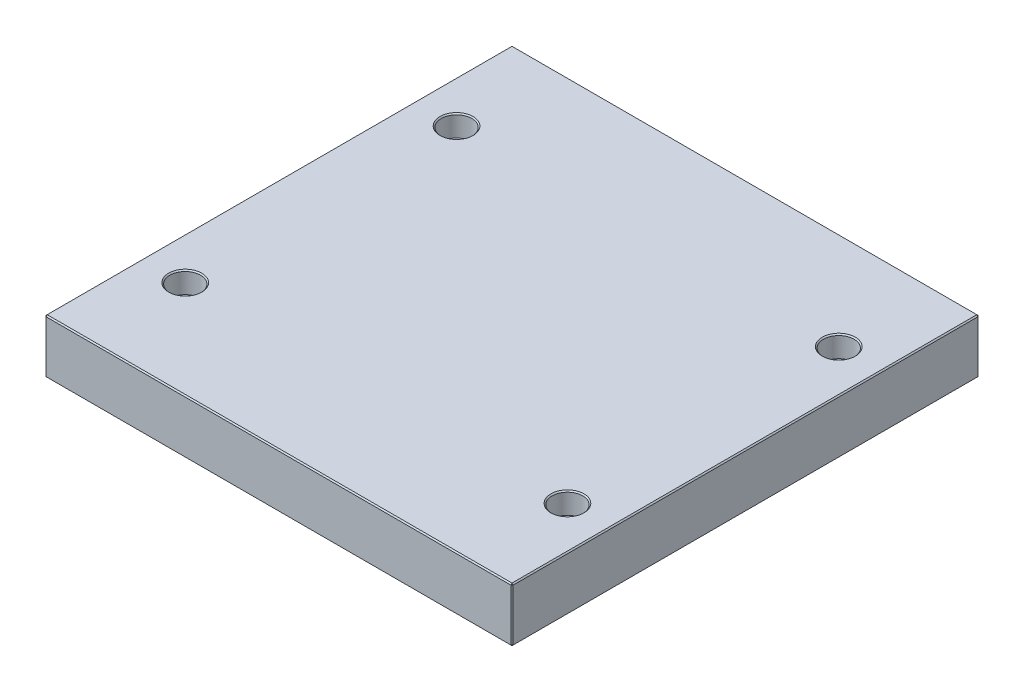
ISO-10303-21;
HEADER;
FILE_DESCRIPTION(('STEP AP214'),'2;1');
FILE_NAME('part.step','',(''),(''),'','','');
FILE_SCHEMA(('AUTOMOTIVE_DESIGN { 1 0 10303 214 1 1 1 1 }'));
ENDSEC;
DATA;
#1=APPLICATION_CONTEXT('core data for automotive mechanical design processes');
#2=APPLICATION_PROTOCOL_DEFINITION('international standard','automotive_design',2000,#1);
#3=PRODUCT_CONTEXT('',#1,'mechanical');
#4=PRODUCT('Part','Part','',(#3));
#5=PRODUCT_RELATED_PRODUCT_CATEGORY('part','',(#4));
#6=PRODUCT_DEFINITION_FORMATION('','',#4);
#7=PRODUCT_DEFINITION_CONTEXT('part definition',#1,'design');
#8=PRODUCT_DEFINITION('design','',#6,#7);
#9=PRODUCT_DEFINITION_SHAPE('','',#8);
#10=(LENGTH_UNIT() NAMED_UNIT(*) SI_UNIT(.MILLI.,.METRE.));
#11=(NAMED_UNIT(*) PLANE_ANGLE_UNIT() SI_UNIT($,.RADIAN.));
#12=(NAMED_UNIT(*) SI_UNIT($,.STERADIAN.) SOLID_ANGLE_UNIT());
#13=UNCERTAINTY_MEASURE_WITH_UNIT(LENGTH_MEASURE(1.E-05),#10,'distance_accuracy_value','');
#14=(GEOMETRIC_REPRESENTATION_CONTEXT(3) GLOBAL_UNCERTAINTY_ASSIGNED_CONTEXT((#13)) GLOBAL_UNIT_ASSIGNED_CONTEXT((#10,
#11,#12)) REPRESENTATION_CONTEXT('',''));
#15=CARTESIAN_POINT('',(0.,0.,0.));
#16=DIRECTION('',(0.,0.,1.));
#17=DIRECTION('',(1.,0.,0.));
#18=AXIS2_PLACEMENT_3D('',#15,#16,#17);
#19=CARTESIAN_POINT('',(-198.,46.,198.));
#20=DIRECTION('',(1.,0.,0.));
#21=DIRECTION('',(0.,0.,-1.));
#22=AXIS2_PLACEMENT_3D('',#19,#20,#21);
#23=PLANE('',#22);
#24=DIRECTION('',(0.,-1.,0.));
#25=VECTOR('',#24,1.);
#26=CARTESIAN_POINT('',(-198.,46.,-197.));
#27=LINE('',#26,#25);
#28=CARTESIAN_POINT('',(-198.,45.,-197.));
#29=VERTEX_POINT('',#28);
#30=CARTESIAN_POINT('',(-198.,1.,-197.));
#31=VERTEX_POINT('',#30);
#32=EDGE_CURVE('E115',#29,#31,#27,.T.);
#33=ORIENTED_EDGE('',*,*,#32,.T.);
#34=DIRECTION('',(0.,0.,1.));
#35=VECTOR('',#34,1.);
#36=CARTESIAN_POINT('',(-198.,1.,198.));
#37=LINE('',#36,#35);
#38=CARTESIAN_POINT('',(-198.,1.,197.));
#39=VERTEX_POINT('',#38);
#40=EDGE_CURVE('E111',#31,#39,#37,.T.);
#41=ORIENTED_EDGE('',*,*,#40,.T.);
#42=DIRECTION('',(0.,1.,0.));
#43=VECTOR('',#42,1.);
#44=CARTESIAN_POINT('',(-198.,46.,197.));
#45=LINE('',#44,#43);
#46=CARTESIAN_POINT('',(-198.,45.,197.));
#47=VERTEX_POINT('',#46);
#48=EDGE_CURVE('E104',#39,#47,#45,.T.);
#49=ORIENTED_EDGE('',*,*,#48,.T.);
#50=DIRECTION('',(0.,0.,-1.));
#51=VECTOR('',#50,1.);
#52=CARTESIAN_POINT('',(-198.,45.,-198.));
#53=LINE('',#52,#51);
#54=EDGE_CURVE('E108',#47,#29,#53,.T.);
#55=ORIENTED_EDGE('',*,*,#54,.T.);
#56=EDGE_LOOP('',(#33,#41,#49,#55));
#57=FACE_BOUND('',#56,.T.);
#58=ADVANCED_FACE('F16',(#57),#23,.F.);
#59=CARTESIAN_POINT('',(198.,46.,198.));
#60=DIRECTION('',(0.,0.,-1.));
#61=DIRECTION('',(-1.,0.,0.));
#62=AXIS2_PLACEMENT_3D('',#59,#60,#61);
#63=PLANE('',#62);
#64=DIRECTION('',(-1.,0.,0.));
#65=VECTOR('',#64,1.);
#66=CARTESIAN_POINT('',(-198.,45.,198.));
#67=LINE('',#66,#65);
#68=CARTESIAN_POINT('',(197.,45.,198.));
#69=VERTEX_POINT('',#68);
#70=CARTESIAN_POINT('',(-197.,45.,198.));
#71=VERTEX_POINT('',#70);
#72=EDGE_CURVE('E170',#69,#71,#67,.T.);
#73=ORIENTED_EDGE('',*,*,#72,.T.);
#74=DIRECTION('',(0.,-1.,0.));
#75=VECTOR('',#74,1.);
#76=CARTESIAN_POINT('',(-197.,46.,198.));
#77=LINE('',#76,#75);
#78=CARTESIAN_POINT('',(-197.,1.00000000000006,198.));
#79=VERTEX_POINT('',#78);
#80=EDGE_CURVE('E123',#71,#79,#77,.T.);
#81=ORIENTED_EDGE('',*,*,#80,.T.);
#82=DIRECTION('',(1.,0.,0.));
#83=VECTOR('',#82,1.);
#84=CARTESIAN_POINT('',(198.,1.00000000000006,198.));
#85=LINE('',#84,#83);
#86=CARTESIAN_POINT('',(197.,1.00000000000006,198.));
#87=VERTEX_POINT('',#86);
#88=EDGE_CURVE('E174',#79,#87,#85,.T.);
#89=ORIENTED_EDGE('',*,*,#88,.T.);
#90=DIRECTION('',(0.,1.,0.));
#91=VECTOR('',#90,1.);
#92=CARTESIAN_POINT('',(197.,46.,198.));
#93=LINE('',#92,#91);
#94=EDGE_CURVE('E172',#87,#69,#93,.T.);
#95=ORIENTED_EDGE('',*,*,#94,.T.);
#96=EDGE_LOOP('',(#73,#81,#89,#95));
#97=FACE_BOUND('',#96,.T.);
#98=ADVANCED_FACE('F317',(#97),#63,.F.);
#99=CARTESIAN_POINT('',(198.,46.,198.));
#100=DIRECTION('',(-1.,0.,0.));
#101=DIRECTION('',(0.,0.,1.));
#102=AXIS2_PLACEMENT_3D('',#99,#100,#101);
#103=PLANE('',#102);
#104=DIRECTION('',(0.,0.,-1.));
#105=VECTOR('',#104,1.);
#106=CARTESIAN_POINT('',(198.,1.00000000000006,198.));
#107=LINE('',#106,#105);
#108=CARTESIAN_POINT('',(198.,1.00000000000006,197.));
#109=VERTEX_POINT('',#108);
#110=CARTESIAN_POINT('',(198.,1.00000000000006,-197.));
#111=VERTEX_POINT('',#110);
#112=EDGE_CURVE('E165',#109,#111,#107,.T.);
#113=ORIENTED_EDGE('',*,*,#112,.T.);
#114=DIRECTION('',(0.,1.,0.));
#115=VECTOR('',#114,1.);
#116=CARTESIAN_POINT('',(198.,46.,-197.));
#117=LINE('',#116,#115);
#118=CARTESIAN_POINT('',(198.,45.,-197.));
#119=VERTEX_POINT('',#118);
#120=EDGE_CURVE('E167',#111,#119,#117,.T.);
#121=ORIENTED_EDGE('',*,*,#120,.T.);
#122=DIRECTION('',(0.,0.,1.));
#123=VECTOR('',#122,1.);
#124=CARTESIAN_POINT('',(198.,45.,198.));
#125=LINE('',#124,#123);
#126=CARTESIAN_POINT('',(198.,45.,197.));
#127=VERTEX_POINT('',#126);
#128=EDGE_CURVE('E161',#119,#127,#125,.T.);
#129=ORIENTED_EDGE('',*,*,#128,.T.);
#130=DIRECTION('',(0.,-1.,0.));
#131=VECTOR('',#130,1.);
#132=CARTESIAN_POINT('',(198.,46.,197.));
#133=LINE('',#132,#131);
#134=EDGE_CURVE('E163',#127,#109,#133,.T.);
#135=ORIENTED_EDGE('',*,*,#134,.T.);
#136=EDGE_LOOP('',(#113,#121,#129,#135));
#137=FACE_BOUND('',#136,.T.);
#138=ADVANCED_FACE('F323',(#137),#103,.F.);
#139=CARTESIAN_POINT('',(198.,46.,-198.));
#140=DIRECTION('',(0.,0.,1.));
#141=DIRECTION('',(1.,0.,0.));
#142=AXIS2_PLACEMENT_3D('',#139,#140,#141);
#143=PLANE('',#142);
#144=DIRECTION('',(0.,-1.,0.));
#145=VECTOR('',#144,1.);
#146=CARTESIAN_POINT('',(197.,46.,-198.));
#147=LINE('',#146,#145);
#148=CARTESIAN_POINT('',(197.,45.,-198.));
#149=VERTEX_POINT('',#148);
#150=CARTESIAN_POINT('',(197.,1.00000000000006,-198.));
#151=VERTEX_POINT('',#150);
#152=EDGE_CURVE('E154',#149,#151,#147,.T.);
#153=ORIENTED_EDGE('',*,*,#152,.T.);
#154=DIRECTION('',(-1.,0.,0.));
#155=VECTOR('',#154,1.);
#156=CARTESIAN_POINT('',(198.,1.00000000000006,-198.));
#157=LINE('',#156,#155);
#158=CARTESIAN_POINT('',(-197.,1.00000000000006,-198.));
#159=VERTEX_POINT('',#158);
#160=EDGE_CURVE('E159',#151,#159,#157,.T.);
#161=ORIENTED_EDGE('',*,*,#160,.T.);
#162=DIRECTION('',(0.,1.,0.));
#163=VECTOR('',#162,1.);
#164=CARTESIAN_POINT('',(-197.,46.,-198.));
#165=LINE('',#164,#163);
#166=CARTESIAN_POINT('',(-197.,45.,-198.));
#167=VERTEX_POINT('',#166);
#168=EDGE_CURVE('E156',#159,#167,#165,.T.);
#169=ORIENTED_EDGE('',*,*,#168,.T.);
#170=DIRECTION('',(1.,0.,0.));
#171=VECTOR('',#170,1.);
#172=CARTESIAN_POINT('',(198.,45.,-198.));
#173=LINE('',#172,#171);
#174=EDGE_CURVE('E152',#167,#149,#173,.T.);
#175=ORIENTED_EDGE('',*,*,#174,.T.);
#176=EDGE_LOOP('',(#153,#161,#169,#175));
#177=FACE_BOUND('',#176,.T.);
#178=ADVANCED_FACE('F465',(#177),#143,.F.);
#179=CARTESIAN_POINT('',(0.,46.,0.));
#180=DIRECTION('',(0.,1.,0.));
#181=DIRECTION('',(0.,0.,1.));
#182=AXIS2_PLACEMENT_3D('',#179,#180,#181);
#183=PLANE('',#182);
#184=CARTESIAN_POINT('',(-162.,46.,115.));
#185=DIRECTION('',(0.,1.,0.));
#186=DIRECTION('',(0.,0.,1.));
#187=AXIS2_PLACEMENT_3D('',#184,#185,#186);
#188=CIRCLE('',#187,14.);
#189=CARTESIAN_POINT('',(-162.,46.,129.));
#190=VERTEX_POINT('',#189);
#191=EDGE_CURVE('E290',#190,#190,#188,.F.);
#192=ORIENTED_EDGE('',*,*,#191,.T.);
#193=EDGE_LOOP('',(#192));
#194=FACE_BOUND('',#193,.T.);
#195=CARTESIAN_POINT('',(162.,46.,115.));
#196=DIRECTION('',(0.,1.,0.));
#197=DIRECTION('',(0.,0.,1.));
#198=AXIS2_PLACEMENT_3D('',#195,#196,#197);
#199=CIRCLE('',#198,14.);
#200=CARTESIAN_POINT('',(162.,46.,129.));
#201=VERTEX_POINT('',#200);
#202=EDGE_CURVE('E287',#201,#201,#199,.F.);
#203=ORIENTED_EDGE('',*,*,#202,.T.);
#204=EDGE_LOOP('',(#203));
#205=FACE_BOUND('',#204,.T.);
#206=CARTESIAN_POINT('',(162.,46.,-115.));
#207=DIRECTION('',(0.,1.,0.));
#208=DIRECTION('',(0.,0.,1.));
#209=AXIS2_PLACEMENT_3D('',#206,#207,#208);
#210=CIRCLE('',#209,14.);
#211=CARTESIAN_POINT('',(162.,46.,-101.));
#212=VERTEX_POINT('',#211);
#213=EDGE_CURVE('E284',#212,#212,#210,.F.);
#214=ORIENTED_EDGE('',*,*,#213,.T.);
#215=EDGE_LOOP('',(#214));
#216=FACE_BOUND('',#215,.T.);
#217=CARTESIAN_POINT('',(-162.,46.,-115.));
#218=DIRECTION('',(0.,1.,0.));
#219=DIRECTION('',(0.,0.,1.));
#220=AXIS2_PLACEMENT_3D('',#217,#218,#219);
#221=CIRCLE('',#220,14.);
#222=CARTESIAN_POINT('',(-162.,46.,-101.));
#223=VERTEX_POINT('',#222);
#224=EDGE_CURVE('E281',#223,#223,#221,.F.);
#225=ORIENTED_EDGE('',*,*,#224,.T.);
#226=EDGE_LOOP('',(#225));
#227=FACE_BOUND('',#226,.T.);
#228=DIRECTION('',(0.,0.,-1.));
#229=VECTOR('',#228,1.);
#230=CARTESIAN_POINT('',(197.,46.,-198.));
#231=LINE('',#230,#229);
#232=CARTESIAN_POINT('',(197.,46.,197.));
#233=VERTEX_POINT('',#232);
#234=CARTESIAN_POINT('',(197.,46.,-197.));
#235=VERTEX_POINT('',#234);
#236=EDGE_CURVE('E31',#233,#235,#231,.T.);
#237=ORIENTED_EDGE('',*,*,#236,.T.);
#238=DIRECTION('',(-1.,0.,0.));
#239=VECTOR('',#238,1.);
#240=CARTESIAN_POINT('',(-198.,46.,-197.));
#241=LINE('',#240,#239);
#242=CARTESIAN_POINT('',(-197.,46.,-197.));
#243=VERTEX_POINT('',#242);
#244=EDGE_CURVE('E190',#235,#243,#241,.T.);
#245=ORIENTED_EDGE('',*,*,#244,.T.);
#246=DIRECTION('',(0.,0.,1.));
#247=VECTOR('',#246,1.);
#248=CARTESIAN_POINT('',(-197.,46.,198.));
#249=LINE('',#248,#247);
#250=CARTESIAN_POINT('',(-197.,46.,197.));
#251=VERTEX_POINT('',#250);
#252=EDGE_CURVE('E186',#243,#251,#249,.T.);
#253=ORIENTED_EDGE('',*,*,#252,.T.);
#254=DIRECTION('',(1.,0.,0.));
#255=VECTOR('',#254,1.);
#256=CARTESIAN_POINT('',(198.,46.,197.));
#257=LINE('',#256,#255);
#258=EDGE_CURVE('E36',#251,#233,#257,.T.);
#259=ORIENTED_EDGE('',*,*,#258,.T.);
#260=EDGE_LOOP('',(#237,#245,#253,#259));
#261=FACE_BOUND('',#260,.T.);
#262=ADVANCED_FACE('F462',(#194,#205,#216,#227,#261),#183,.T.);
#263=CARTESIAN_POINT('',(0.,0.,0.));
#264=DIRECTION('',(0.,1.,0.));
#265=DIRECTION('',(0.,0.,1.));
#266=AXIS2_PLACEMENT_3D('',#263,#264,#265);
#267=PLANE('',#266);
#268=CARTESIAN_POINT('',(162.,0.,-115.));
#269=DIRECTION('',(0.,1.,0.));
#270=DIRECTION('',(0.,0.,1.));
#271=AXIS2_PLACEMENT_3D('',#268,#269,#270);
#272=CIRCLE('',#271,10.);
#273=CARTESIAN_POINT('',(162.,0.,-105.));
#274=VERTEX_POINT('',#273);
#275=EDGE_CURVE('E263',#274,#274,#272,.T.);
#276=ORIENTED_EDGE('',*,*,#275,.T.);
#277=EDGE_LOOP('',(#276));
#278=FACE_BOUND('',#277,.T.);
#279=CARTESIAN_POINT('',(162.,0.,115.));
#280=DIRECTION('',(0.,1.,0.));
#281=DIRECTION('',(0.,0.,1.));
#282=AXIS2_PLACEMENT_3D('',#279,#280,#281);
#283=CIRCLE('',#282,10.);
#284=CARTESIAN_POINT('',(162.,0.,125.));
#285=VERTEX_POINT('',#284);
#286=EDGE_CURVE('E260',#285,#285,#283,.T.);
#287=ORIENTED_EDGE('',*,*,#286,.T.);
#288=EDGE_LOOP('',(#287));
#289=FACE_BOUND('',#288,.T.);
#290=CARTESIAN_POINT('',(-162.,0.,115.));
#291=DIRECTION('',(0.,1.,0.));
#292=DIRECTION('',(0.,0.,1.));
#293=AXIS2_PLACEMENT_3D('',#290,#291,#292);
#294=CIRCLE('',#293,10.);
#295=CARTESIAN_POINT('',(-162.,0.,125.));
#296=VERTEX_POINT('',#295);
#297=EDGE_CURVE('E257',#296,#296,#294,.T.);
#298=ORIENTED_EDGE('',*,*,#297,.T.);
#299=EDGE_LOOP('',(#298));
#300=FACE_BOUND('',#299,.T.);
#301=CARTESIAN_POINT('',(-162.,0.,-115.));
#302=DIRECTION('',(0.,1.,0.));
#303=DIRECTION('',(0.,0.,1.));
#304=AXIS2_PLACEMENT_3D('',#301,#302,#303);
#305=CIRCLE('',#304,10.);
#306=CARTESIAN_POINT('',(-162.,0.,-105.));
#307=VERTEX_POINT('',#306);
#308=EDGE_CURVE('E192',#307,#307,#305,.T.);
#309=ORIENTED_EDGE('',*,*,#308,.T.);
#310=EDGE_LOOP('',(#309));
#311=FACE_BOUND('',#310,.T.);
#312=DIRECTION('',(0.,0.,1.));
#313=VECTOR('',#312,1.);
#314=CARTESIAN_POINT('',(197.,0.,0.));
#315=LINE('',#314,#313);
#316=CARTESIAN_POINT('',(197.,0.,-197.));
#317=VERTEX_POINT('',#316);
#318=CARTESIAN_POINT('',(197.,0.,197.));
#319=VERTEX_POINT('',#318);
#320=EDGE_CURVE('E177',#317,#319,#315,.T.);
#321=ORIENTED_EDGE('',*,*,#320,.T.);
#322=DIRECTION('',(-1.,0.,0.));
#323=VECTOR('',#322,1.);
#324=CARTESIAN_POINT('',(0.,0.,197.));
#325=LINE('',#324,#323);
#326=CARTESIAN_POINT('',(-197.,0.,197.));
#327=VERTEX_POINT('',#326);
#328=EDGE_CURVE('E183',#319,#327,#325,.T.);
#329=ORIENTED_EDGE('',*,*,#328,.T.);
#330=DIRECTION('',(0.,0.,-1.));
#331=VECTOR('',#330,1.);
#332=CARTESIAN_POINT('',(-197.,0.,0.));
#333=LINE('',#332,#331);
#334=CARTESIAN_POINT('',(-197.,0.,-197.));
#335=VERTEX_POINT('',#334);
#336=EDGE_CURVE('E181',#327,#335,#333,.T.);
#337=ORIENTED_EDGE('',*,*,#336,.T.);
#338=DIRECTION('',(1.,0.,0.));
#339=VECTOR('',#338,1.);
#340=CARTESIAN_POINT('',(0.,0.,-197.));
#341=LINE('',#340,#339);
#342=EDGE_CURVE('E179',#335,#317,#341,.T.);
#343=ORIENTED_EDGE('',*,*,#342,.T.);
#344=EDGE_LOOP('',(#321,#329,#337,#343));
#345=FACE_BOUND('',#344,.T.);
#346=ADVANCED_FACE('F402',(#278,#289,#300,#311,#345),#267,.F.);
#347=CARTESIAN_POINT('',(198.,46.,197.));
#348=DIRECTION('',(-0.707106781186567,0.,-0.707106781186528));
#349=DIRECTION('',(0.,-1.,0.));
#350=AXIS2_PLACEMENT_3D('',#347,#348,#349);
#351=PLANE('',#350);
#352=DIRECTION('',(-0.707106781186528,0.,0.707106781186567));
#353=VECTOR('',#352,1.);
#354=CARTESIAN_POINT('',(197.,45.,198.));
#355=LINE('',#354,#353);
#356=EDGE_CURVE('E141',#69,#127,#355,.F.);
#357=ORIENTED_EDGE('',*,*,#356,.F.);
#358=ORIENTED_EDGE('',*,*,#94,.F.);
#359=DIRECTION('',(0.707106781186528,0.,-0.707106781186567));
#360=VECTOR('',#359,1.);
#361=CARTESIAN_POINT('',(197.,1.00000000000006,198.));
#362=LINE('',#361,#360);
#363=EDGE_CURVE('E144',#109,#87,#362,.F.);
#364=ORIENTED_EDGE('',*,*,#363,.F.);
#365=ORIENTED_EDGE('',*,*,#134,.F.);
#366=EDGE_LOOP('',(#357,#358,#364,#365));
#367=FACE_BOUND('',#366,.T.);
#368=ADVANCED_FACE('F398',(#367),#351,.F.);
#369=CARTESIAN_POINT('',(197.,45.,198.));
#370=DIRECTION('',(0.577350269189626,0.577350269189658,0.577350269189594));
#371=DIRECTION('',(-0.707106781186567,0.707106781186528,0.));
#372=AXIS2_PLACEMENT_3D('',#369,#370,#371);
#373=PLANE('',#372);
#374=DIRECTION('',(0.,-0.707106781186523,0.707106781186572));
#375=VECTOR('',#374,1.);
#376=CARTESIAN_POINT('',(197.,45.,198.));
#377=LINE('',#376,#375);
#378=EDGE_CURVE('E235',#69,#233,#377,.F.);
#379=ORIENTED_EDGE('',*,*,#378,.F.);
#380=ORIENTED_EDGE('',*,*,#356,.T.);
#381=DIRECTION('',(-0.707106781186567,0.707106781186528,0.));
#382=VECTOR('',#381,1.);
#383=CARTESIAN_POINT('',(197.5,45.5,197.));
#384=LINE('',#383,#382);
#385=EDGE_CURVE('E237',#233,#127,#384,.F.);
#386=ORIENTED_EDGE('',*,*,#385,.F.);
#387=EDGE_LOOP('',(#379,#380,#386));
#388=FACE_BOUND('',#387,.T.);
#389=ADVANCED_FACE('F394',(#388),#373,.T.);
#390=CARTESIAN_POINT('',(197.,1.00000000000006,198.));
#391=DIRECTION('',(0.577350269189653,-0.577350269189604,0.57735026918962));
#392=DIRECTION('',(0.707106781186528,0.,-0.707106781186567));
#393=AXIS2_PLACEMENT_3D('',#390,#391,#392);
#394=PLANE('',#393);
#395=DIRECTION('',(-0.707106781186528,-0.707106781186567,0.));
#396=VECTOR('',#395,1.);
#397=CARTESIAN_POINT('',(197.5,0.500000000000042,197.));
#398=LINE('',#397,#396);
#399=EDGE_CURVE('E229',#109,#319,#398,.T.);
#400=ORIENTED_EDGE('',*,*,#399,.F.);
#401=ORIENTED_EDGE('',*,*,#363,.T.);
#402=DIRECTION('',(0.,0.707106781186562,0.707106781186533));
#403=VECTOR('',#402,1.);
#404=CARTESIAN_POINT('',(197.,1.00000000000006,198.));
#405=LINE('',#404,#403);
#406=EDGE_CURVE('E232',#319,#87,#405,.T.);
#407=ORIENTED_EDGE('',*,*,#406,.F.);
#408=EDGE_LOOP('',(#400,#401,#407));
#409=FACE_BOUND('',#408,.T.);
#410=ADVANCED_FACE('F390',(#409),#394,.T.);
#411=CARTESIAN_POINT('',(197.,46.,0.));
#412=DIRECTION('',(0.707106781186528,0.707106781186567,0.));
#413=DIRECTION('',(0.,0.,1.));
#414=AXIS2_PLACEMENT_3D('',#411,#412,#413);
#415=PLANE('',#414);
#416=ORIENTED_EDGE('',*,*,#385,.T.);
#417=ORIENTED_EDGE('',*,*,#128,.F.);
#418=DIRECTION('',(0.707106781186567,-0.707106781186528,0.));
#419=VECTOR('',#418,1.);
#420=CARTESIAN_POINT('',(198.,45.,-197.));
#421=LINE('',#420,#419);
#422=EDGE_CURVE('E224',#235,#119,#421,.T.);
#423=ORIENTED_EDGE('',*,*,#422,.F.);
#424=ORIENTED_EDGE('',*,*,#236,.F.);
#425=EDGE_LOOP('',(#416,#417,#423,#424));
#426=FACE_BOUND('',#425,.T.);
#427=ADVANCED_FACE('F386',(#426),#415,.T.);
#428=CARTESIAN_POINT('',(0.,46.,197.));
#429=DIRECTION('',(0.,0.707106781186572,0.707106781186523));
#430=DIRECTION('',(-1.,0.,0.));
#431=AXIS2_PLACEMENT_3D('',#428,#429,#430);
#432=PLANE('',#431);
#433=ORIENTED_EDGE('',*,*,#378,.T.);
#434=ORIENTED_EDGE('',*,*,#258,.F.);
#435=DIRECTION('',(0.,0.707106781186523,-0.707106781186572));
#436=VECTOR('',#435,1.);
#437=CARTESIAN_POINT('',(-197.,45.5,197.5));
#438=LINE('',#437,#436);
#439=EDGE_CURVE('E127',#71,#251,#438,.T.);
#440=ORIENTED_EDGE('',*,*,#439,.F.);
#441=ORIENTED_EDGE('',*,*,#72,.F.);
#442=EDGE_LOOP('',(#433,#434,#440,#441));
#443=FACE_BOUND('',#442,.T.);
#444=ADVANCED_FACE('F383',(#443),#432,.T.);
#445=CARTESIAN_POINT('',(-197.,46.,198.));
#446=DIRECTION('',(0.707106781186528,0.,-0.707106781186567));
#447=DIRECTION('',(0.,-1.,0.));
#448=AXIS2_PLACEMENT_3D('',#445,#446,#447);
#449=PLANE('',#448);
#450=DIRECTION('',(0.707106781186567,0.,0.707106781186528));
#451=VECTOR('',#450,1.);
#452=CARTESIAN_POINT('',(-197.,1.00000000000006,198.));
#453=LINE('',#452,#451);
#454=EDGE_CURVE('E128',#79,#39,#453,.F.);
#455=ORIENTED_EDGE('',*,*,#454,.F.);
#456=ORIENTED_EDGE('',*,*,#80,.F.);
#457=DIRECTION('',(-0.707106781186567,0.,-0.707106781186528));
#458=VECTOR('',#457,1.);
#459=CARTESIAN_POINT('',(-198.,45.,197.));
#460=LINE('',#459,#458);
#461=EDGE_CURVE('E119',#47,#71,#460,.F.);
#462=ORIENTED_EDGE('',*,*,#461,.F.);
#463=ORIENTED_EDGE('',*,*,#48,.F.);
#464=EDGE_LOOP('',(#455,#456,#462,#463));
#465=FACE_BOUND('',#464,.T.);
#466=ADVANCED_FACE('F121',(#465),#449,.F.);
#467=CARTESIAN_POINT('',(198.,1.00000000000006,198.));
#468=DIRECTION('',(0.,0.707106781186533,-0.707106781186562));
#469=DIRECTION('',(1.,0.,0.));
#470=AXIS2_PLACEMENT_3D('',#467,#468,#469);
#471=PLANE('',#470);
#472=ORIENTED_EDGE('',*,*,#406,.T.);
#473=ORIENTED_EDGE('',*,*,#88,.F.);
#474=DIRECTION('',(0.,-0.707106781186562,-0.707106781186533));
#475=VECTOR('',#474,1.);
#476=CARTESIAN_POINT('',(-197.,1.00000000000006,198.));
#477=LINE('',#476,#475);
#478=EDGE_CURVE('E220',#327,#79,#477,.F.);
#479=ORIENTED_EDGE('',*,*,#478,.F.);
#480=ORIENTED_EDGE('',*,*,#328,.F.);
#481=EDGE_LOOP('',(#472,#473,#479,#480));
#482=FACE_BOUND('',#481,.T.);
#483=ADVANCED_FACE('F376',(#482),#471,.F.);
#484=CARTESIAN_POINT('',(198.,1.00000000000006,198.));
#485=DIRECTION('',(-0.707106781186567,0.707106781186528,0.));
#486=DIRECTION('',(0.,0.,-1.));
#487=AXIS2_PLACEMENT_3D('',#484,#485,#486);
#488=PLANE('',#487);
#489=ORIENTED_EDGE('',*,*,#399,.T.);
#490=ORIENTED_EDGE('',*,*,#320,.F.);
#491=DIRECTION('',(0.707106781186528,0.707106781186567,0.));
#492=VECTOR('',#491,1.);
#493=CARTESIAN_POINT('',(197.5,0.500000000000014,-197.));
#494=LINE('',#493,#492);
#495=EDGE_CURVE('E217',#111,#317,#494,.F.);
#496=ORIENTED_EDGE('',*,*,#495,.F.);
#497=ORIENTED_EDGE('',*,*,#112,.F.);
#498=EDGE_LOOP('',(#489,#490,#496,#497));
#499=FACE_BOUND('',#498,.T.);
#500=ADVANCED_FACE('F372',(#499),#488,.F.);
#501=CARTESIAN_POINT('',(197.,46.,-198.));
#502=DIRECTION('',(-0.707106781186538,0.,0.707106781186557));
#503=DIRECTION('',(0.,-1.,0.));
#504=AXIS2_PLACEMENT_3D('',#501,#502,#503);
#505=PLANE('',#504);
#506=DIRECTION('',(0.707106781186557,0.,0.707106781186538));
#507=VECTOR('',#506,1.);
#508=CARTESIAN_POINT('',(198.,45.,-197.));
#509=LINE('',#508,#507);
#510=EDGE_CURVE('E226',#119,#149,#509,.F.);
#511=ORIENTED_EDGE('',*,*,#510,.F.);
#512=ORIENTED_EDGE('',*,*,#120,.F.);
#513=DIRECTION('',(-0.707106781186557,0.,-0.707106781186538));
#514=VECTOR('',#513,1.);
#515=CARTESIAN_POINT('',(197.,1.00000000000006,-198.));
#516=LINE('',#515,#514);
#517=EDGE_CURVE('E214',#151,#111,#516,.F.);
#518=ORIENTED_EDGE('',*,*,#517,.F.);
#519=ORIENTED_EDGE('',*,*,#152,.F.);
#520=EDGE_LOOP('',(#511,#512,#518,#519));
#521=FACE_BOUND('',#520,.T.);
#522=ADVANCED_FACE('F368',(#521),#505,.F.);
#523=CARTESIAN_POINT('',(198.,45.,-197.));
#524=DIRECTION('',(0.577350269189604,0.577350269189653,-0.57735026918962));
#525=DIRECTION('',(0.,0.707106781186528,0.707106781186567));
#526=AXIS2_PLACEMENT_3D('',#523,#524,#525);
#527=PLANE('',#526);
#528=ORIENTED_EDGE('',*,*,#422,.T.);
#529=ORIENTED_EDGE('',*,*,#510,.T.);
#530=DIRECTION('',(0.,0.707106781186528,0.707106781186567));
#531=VECTOR('',#530,1.);
#532=CARTESIAN_POINT('',(197.,45.5,-197.5));
#533=LINE('',#532,#531);
#534=EDGE_CURVE('E135',#235,#149,#533,.F.);
#535=ORIENTED_EDGE('',*,*,#534,.F.);
#536=EDGE_LOOP('',(#528,#529,#535));
#537=FACE_BOUND('',#536,.T.);
#538=ADVANCED_FACE('F365',(#537),#527,.T.);
#539=CARTESIAN_POINT('',(-198.,45.,197.));
#540=DIRECTION('',(-0.577350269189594,0.577350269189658,0.577350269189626));
#541=DIRECTION('',(0.,-0.707106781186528,0.707106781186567));
#542=AXIS2_PLACEMENT_3D('',#539,#540,#541);
#543=PLANE('',#542);
#544=ORIENTED_EDGE('',*,*,#461,.T.);
#545=ORIENTED_EDGE('',*,*,#439,.T.);
#546=DIRECTION('',(-0.707106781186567,-0.707106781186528,0.));
#547=VECTOR('',#546,1.);
#548=CARTESIAN_POINT('',(-198.,45.,197.));
#549=LINE('',#548,#547);
#550=EDGE_CURVE('E131',#47,#251,#549,.F.);
#551=ORIENTED_EDGE('',*,*,#550,.F.);
#552=EDGE_LOOP('',(#544,#545,#551));
#553=FACE_BOUND('',#552,.T.);
#554=ADVANCED_FACE('F132',(#553),#543,.T.);
#555=CARTESIAN_POINT('',(-197.,1.00000000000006,198.));
#556=DIRECTION('',(-0.577350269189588,-0.577350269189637,0.577350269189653));
#557=DIRECTION('',(0.,-0.707106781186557,-0.707106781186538));
#558=AXIS2_PLACEMENT_3D('',#555,#556,#557);
#559=PLANE('',#558);
#560=ORIENTED_EDGE('',*,*,#478,.T.);
#561=ORIENTED_EDGE('',*,*,#454,.T.);
#562=DIRECTION('',(-0.707106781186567,0.707106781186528,0.));
#563=VECTOR('',#562,1.);
#564=CARTESIAN_POINT('',(-197.5,0.500000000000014,197.));
#565=LINE('',#564,#563);
#566=EDGE_CURVE('E136',#327,#39,#565,.T.);
#567=ORIENTED_EDGE('',*,*,#566,.F.);
#568=EDGE_LOOP('',(#560,#561,#567));
#569=FACE_BOUND('',#568,.T.);
#570=ADVANCED_FACE('F358',(#569),#559,.T.);
#571=CARTESIAN_POINT('',(197.,1.00000000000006,-198.));
#572=DIRECTION('',(0.577350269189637,-0.577350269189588,-0.577350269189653));
#573=DIRECTION('',(-0.707106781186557,0.,-0.707106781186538));
#574=AXIS2_PLACEMENT_3D('',#571,#572,#573);
#575=PLANE('',#574);
#576=ORIENTED_EDGE('',*,*,#517,.T.);
#577=ORIENTED_EDGE('',*,*,#495,.T.);
#578=DIRECTION('',(0.,-0.707106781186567,0.707106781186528));
#579=VECTOR('',#578,1.);
#580=CARTESIAN_POINT('',(197.,1.00000000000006,-198.));
#581=LINE('',#580,#579);
#582=EDGE_CURVE('E207',#151,#317,#581,.T.);
#583=ORIENTED_EDGE('',*,*,#582,.F.);
#584=EDGE_LOOP('',(#576,#577,#583));
#585=FACE_BOUND('',#584,.T.);
#586=ADVANCED_FACE('F354',(#585),#575,.T.);
#587=CARTESIAN_POINT('',(0.,46.,-197.));
#588=DIRECTION('',(0.,0.707106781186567,-0.707106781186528));
#589=DIRECTION('',(1.,0.,0.));
#590=AXIS2_PLACEMENT_3D('',#587,#588,#589);
#591=PLANE('',#590);
#592=ORIENTED_EDGE('',*,*,#534,.T.);
#593=ORIENTED_EDGE('',*,*,#174,.F.);
#594=DIRECTION('',(0.,-0.707106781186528,-0.707106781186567));
#595=VECTOR('',#594,1.);
#596=CARTESIAN_POINT('',(-197.,45.,-198.));
#597=LINE('',#596,#595);
#598=EDGE_CURVE('E204',#243,#167,#597,.T.);
#599=ORIENTED_EDGE('',*,*,#598,.F.);
#600=ORIENTED_EDGE('',*,*,#244,.F.);
#601=EDGE_LOOP('',(#592,#593,#599,#600));
#602=FACE_BOUND('',#601,.T.);
#603=ADVANCED_FACE('F351',(#602),#591,.T.);
#604=CARTESIAN_POINT('',(-197.,46.,0.));
#605=DIRECTION('',(-0.707106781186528,0.707106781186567,0.));
#606=DIRECTION('',(0.,0.,-1.));
#607=AXIS2_PLACEMENT_3D('',#604,#605,#606);
#608=PLANE('',#607);
#609=ORIENTED_EDGE('',*,*,#550,.T.);
#610=ORIENTED_EDGE('',*,*,#252,.F.);
#611=DIRECTION('',(0.707106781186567,0.707106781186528,0.));
#612=VECTOR('',#611,1.);
#613=CARTESIAN_POINT('',(-197.5,45.5,-197.));
#614=LINE('',#613,#612);
#615=EDGE_CURVE('E139',#29,#243,#614,.T.);
#616=ORIENTED_EDGE('',*,*,#615,.F.);
#617=ORIENTED_EDGE('',*,*,#54,.F.);
#618=EDGE_LOOP('',(#609,#610,#616,#617));
#619=FACE_BOUND('',#618,.T.);
#620=ADVANCED_FACE('F138',(#619),#608,.T.);
#621=CARTESIAN_POINT('',(-198.,1.,198.));
#622=DIRECTION('',(0.707106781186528,0.707106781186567,0.));
#623=DIRECTION('',(0.,0.,1.));
#624=AXIS2_PLACEMENT_3D('',#621,#622,#623);
#625=PLANE('',#624);
#626=ORIENTED_EDGE('',*,*,#566,.T.);
#627=ORIENTED_EDGE('',*,*,#40,.F.);
#628=DIRECTION('',(0.707106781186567,-0.707106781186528,0.));
#629=VECTOR('',#628,1.);
#630=CARTESIAN_POINT('',(-198.,1.,-197.));
#631=LINE('',#630,#629);
#632=EDGE_CURVE('E200',#335,#31,#631,.F.);
#633=ORIENTED_EDGE('',*,*,#632,.F.);
#634=ORIENTED_EDGE('',*,*,#336,.F.);
#635=EDGE_LOOP('',(#626,#627,#633,#634));
#636=FACE_BOUND('',#635,.T.);
#637=ADVANCED_FACE('F344',(#636),#625,.F.);
#638=CARTESIAN_POINT('',(198.,1.00000000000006,-198.));
#639=DIRECTION('',(0.,0.707106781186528,0.707106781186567));
#640=DIRECTION('',(-1.,0.,0.));
#641=AXIS2_PLACEMENT_3D('',#638,#639,#640);
#642=PLANE('',#641);
#643=ORIENTED_EDGE('',*,*,#582,.T.);
#644=ORIENTED_EDGE('',*,*,#342,.F.);
#645=DIRECTION('',(0.,0.707106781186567,-0.707106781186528));
#646=VECTOR('',#645,1.);
#647=CARTESIAN_POINT('',(-197.,0.500000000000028,-197.5));
#648=LINE('',#647,#646);
#649=EDGE_CURVE('E197',#159,#335,#648,.F.);
#650=ORIENTED_EDGE('',*,*,#649,.F.);
#651=ORIENTED_EDGE('',*,*,#160,.F.);
#652=EDGE_LOOP('',(#643,#644,#650,#651));
#653=FACE_BOUND('',#652,.T.);
#654=ADVANCED_FACE('F340',(#653),#642,.F.);
#655=CARTESIAN_POINT('',(-197.,45.,-198.));
#656=DIRECTION('',(-0.577350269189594,0.577350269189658,-0.577350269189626));
#657=DIRECTION('',(0.,0.707106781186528,0.707106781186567));
#658=AXIS2_PLACEMENT_3D('',#655,#656,#657);
#659=PLANE('',#658);
#660=ORIENTED_EDGE('',*,*,#615,.T.);
#661=ORIENTED_EDGE('',*,*,#598,.T.);
#662=DIRECTION('',(0.707106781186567,0.,-0.707106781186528));
#663=VECTOR('',#662,1.);
#664=CARTESIAN_POINT('',(-197.,45.,-198.));
#665=LINE('',#664,#663);
#666=EDGE_CURVE('E195',#29,#167,#665,.T.);
#667=ORIENTED_EDGE('',*,*,#666,.F.);
#668=EDGE_LOOP('',(#660,#661,#667));
#669=FACE_BOUND('',#668,.T.);
#670=ADVANCED_FACE('F336',(#669),#659,.T.);
#671=CARTESIAN_POINT('',(-198.,1.,-197.));
#672=DIRECTION('',(-0.577350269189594,-0.577350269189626,-0.577350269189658));
#673=DIRECTION('',(0.,0.707106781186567,-0.707106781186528));
#674=AXIS2_PLACEMENT_3D('',#671,#672,#673);
#675=PLANE('',#674);
#676=ORIENTED_EDGE('',*,*,#649,.T.);
#677=ORIENTED_EDGE('',*,*,#632,.T.);
#678=DIRECTION('',(-0.707106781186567,0.,0.707106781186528));
#679=VECTOR('',#678,1.);
#680=CARTESIAN_POINT('',(-198.,1.,-197.));
#681=LINE('',#680,#679);
#682=EDGE_CURVE('E193',#159,#31,#681,.T.);
#683=ORIENTED_EDGE('',*,*,#682,.F.);
#684=EDGE_LOOP('',(#676,#677,#683));
#685=FACE_BOUND('',#684,.T.);
#686=ADVANCED_FACE('F332',(#685),#675,.T.);
#687=CARTESIAN_POINT('',(-198.,46.,-197.));
#688=DIRECTION('',(0.707106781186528,0.,0.707106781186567));
#689=DIRECTION('',(0.,-1.,0.));
#690=AXIS2_PLACEMENT_3D('',#687,#688,#689);
#691=PLANE('',#690);
#692=ORIENTED_EDGE('',*,*,#666,.T.);
#693=ORIENTED_EDGE('',*,*,#168,.F.);
#694=ORIENTED_EDGE('',*,*,#682,.T.);
#695=ORIENTED_EDGE('',*,*,#32,.F.);
#696=EDGE_LOOP('',(#692,#693,#694,#695));
#697=FACE_BOUND('',#696,.T.);
#698=ADVANCED_FACE('F328',(#697),#691,.F.);
#699=CARTESIAN_POINT('',(-162.,28.,-115.));
#700=DIRECTION('',(0.,1.,0.));
#701=DIRECTION('',(0.,0.,1.));
#702=AXIS2_PLACEMENT_3D('',#699,#700,#701);
#703=CYLINDRICAL_SURFACE('',#702,13.);
#704=CARTESIAN_POINT('',(-162.,45.,-115.));
#705=DIRECTION('',(0.,1.,0.));
#706=DIRECTION('',(0.,0.,1.));
#707=AXIS2_PLACEMENT_3D('',#704,#705,#706);
#708=CIRCLE('',#707,13.);
#709=CARTESIAN_POINT('',(-162.,45.,-102.));
#710=VERTEX_POINT('',#709);
#711=EDGE_CURVE('E10',#710,#710,#708,.T.);
#712=ORIENTED_EDGE('',*,*,#711,.T.);
#713=EDGE_LOOP('',(#712));
#714=FACE_BOUND('',#713,.T.);
#715=CARTESIAN_POINT('',(-162.,28.,-115.));
#716=DIRECTION('',(0.,1.,0.));
#717=DIRECTION('',(0.,0.,1.));
#718=AXIS2_PLACEMENT_3D('',#715,#716,#717);
#719=CIRCLE('',#718,13.);
#720=CARTESIAN_POINT('',(-162.,28.,-102.));
#721=VERTEX_POINT('',#720);
#722=EDGE_CURVE('E147',#721,#721,#719,.T.);
#723=ORIENTED_EDGE('',*,*,#722,.F.);
#724=EDGE_LOOP('',(#723));
#725=FACE_BOUND('',#724,.T.);
#726=ADVANCED_FACE('F331',(#714,#725),#703,.F.);
#727=CARTESIAN_POINT('',(-162.,28.,-115.));
#728=DIRECTION('',(0.,1.,0.));
#729=DIRECTION('',(0.,0.,1.));
#730=AXIS2_PLACEMENT_3D('',#727,#728,#729);
#731=PLANE('',#730);
#732=CARTESIAN_POINT('',(-162.,28.,-115.));
#733=DIRECTION('',(0.,1.,0.));
#734=DIRECTION('',(0.,0.,1.));
#735=AXIS2_PLACEMENT_3D('',#732,#733,#734);
#736=CIRCLE('',#735,9.);
#737=CARTESIAN_POINT('',(-162.,28.,-106.));
#738=VERTEX_POINT('',#737);
#739=EDGE_CURVE('E251',#738,#738,#736,.T.);
#740=ORIENTED_EDGE('',*,*,#739,.F.);
#741=EDGE_LOOP('',(#740));
#742=FACE_BOUND('',#741,.T.);
#743=ORIENTED_EDGE('',*,*,#722,.T.);
#744=EDGE_LOOP('',(#743));
#745=FACE_BOUND('',#744,.T.);
#746=ADVANCED_FACE('F450',(#742,#745),#731,.T.);
#747=CARTESIAN_POINT('',(162.,28.,-115.));
#748=DIRECTION('',(0.,1.,0.));
#749=DIRECTION('',(0.,0.,1.));
#750=AXIS2_PLACEMENT_3D('',#747,#748,#749);
#751=CYLINDRICAL_SURFACE('',#750,13.);
#752=CARTESIAN_POINT('',(162.,45.,-115.));
#753=DIRECTION('',(0.,1.,0.));
#754=DIRECTION('',(0.,0.,1.));
#755=AXIS2_PLACEMENT_3D('',#752,#753,#754);
#756=CIRCLE('',#755,13.);
#757=CARTESIAN_POINT('',(162.,45.,-102.));
#758=VERTEX_POINT('',#757);
#759=EDGE_CURVE('E24',#758,#758,#756,.T.);
#760=ORIENTED_EDGE('',*,*,#759,.T.);
#761=EDGE_LOOP('',(#760));
#762=FACE_BOUND('',#761,.T.);
#763=CARTESIAN_POINT('',(162.,28.,-115.));
#764=DIRECTION('',(0.,1.,0.));
#765=DIRECTION('',(0.,0.,1.));
#766=AXIS2_PLACEMENT_3D('',#763,#764,#765);
#767=CIRCLE('',#766,13.);
#768=CARTESIAN_POINT('',(162.,28.,-102.));
#769=VERTEX_POINT('',#768);
#770=EDGE_CURVE('E441',#769,#769,#767,.T.);
#771=ORIENTED_EDGE('',*,*,#770,.F.);
#772=EDGE_LOOP('',(#771));
#773=FACE_BOUND('',#772,.T.);
#774=ADVANCED_FACE('F298',(#762,#773),#751,.F.);
#775=CARTESIAN_POINT('',(162.,28.,-115.));
#776=DIRECTION('',(0.,1.,0.));
#777=DIRECTION('',(0.,0.,1.));
#778=AXIS2_PLACEMENT_3D('',#775,#776,#777);
#779=PLANE('',#778);
#780=CARTESIAN_POINT('',(162.,28.,-115.));
#781=DIRECTION('',(0.,1.,0.));
#782=DIRECTION('',(0.,0.,1.));
#783=AXIS2_PLACEMENT_3D('',#780,#781,#782);
#784=CIRCLE('',#783,9.);
#785=CARTESIAN_POINT('',(162.,28.,-106.));
#786=VERTEX_POINT('',#785);
#787=EDGE_CURVE('E248',#786,#786,#784,.T.);
#788=ORIENTED_EDGE('',*,*,#787,.F.);
#789=EDGE_LOOP('',(#788));
#790=FACE_BOUND('',#789,.T.);
#791=ORIENTED_EDGE('',*,*,#770,.T.);
#792=EDGE_LOOP('',(#791));
#793=FACE_BOUND('',#792,.T.);
#794=ADVANCED_FACE('F738',(#790,#793),#779,.T.);
#795=CARTESIAN_POINT('',(162.,28.,115.));
#796=DIRECTION('',(0.,1.,0.));
#797=DIRECTION('',(0.,0.,1.));
#798=AXIS2_PLACEMENT_3D('',#795,#796,#797);
#799=CYLINDRICAL_SURFACE('',#798,13.);
#800=CARTESIAN_POINT('',(162.,45.,115.));
#801=DIRECTION('',(0.,1.,0.));
#802=DIRECTION('',(0.,0.,1.));
#803=AXIS2_PLACEMENT_3D('',#800,#801,#802);
#804=CIRCLE('',#803,13.);
#805=CARTESIAN_POINT('',(162.,45.,128.));
#806=VERTEX_POINT('',#805);
#807=EDGE_CURVE('E293',#806,#806,#804,.T.);
#808=ORIENTED_EDGE('',*,*,#807,.T.);
#809=EDGE_LOOP('',(#808));
#810=FACE_BOUND('',#809,.T.);
#811=CARTESIAN_POINT('',(162.,28.,115.));
#812=DIRECTION('',(0.,1.,0.));
#813=DIRECTION('',(0.,0.,1.));
#814=AXIS2_PLACEMENT_3D('',#811,#812,#813);
#815=CIRCLE('',#814,13.);
#816=CARTESIAN_POINT('',(162.,28.,128.));
#817=VERTEX_POINT('',#816);
#818=EDGE_CURVE('E439',#817,#817,#815,.T.);
#819=ORIENTED_EDGE('',*,*,#818,.F.);
#820=EDGE_LOOP('',(#819));
#821=FACE_BOUND('',#820,.T.);
#822=ADVANCED_FACE('F730',(#810,#821),#799,.F.);
#823=CARTESIAN_POINT('',(162.,28.,115.));
#824=DIRECTION('',(0.,1.,0.));
#825=DIRECTION('',(0.,0.,1.));
#826=AXIS2_PLACEMENT_3D('',#823,#824,#825);
#827=PLANE('',#826);
#828=CARTESIAN_POINT('',(162.,28.,115.));
#829=DIRECTION('',(0.,1.,0.));
#830=DIRECTION('',(0.,0.,1.));
#831=AXIS2_PLACEMENT_3D('',#828,#829,#830);
#832=CIRCLE('',#831,9.);
#833=CARTESIAN_POINT('',(162.,28.,124.));
#834=VERTEX_POINT('',#833);
#835=EDGE_CURVE('E245',#834,#834,#832,.T.);
#836=ORIENTED_EDGE('',*,*,#835,.F.);
#837=EDGE_LOOP('',(#836));
#838=FACE_BOUND('',#837,.T.);
#839=ORIENTED_EDGE('',*,*,#818,.T.);
#840=EDGE_LOOP('',(#839));
#841=FACE_BOUND('',#840,.T.);
#842=ADVANCED_FACE('F434',(#838,#841),#827,.T.);
#843=CARTESIAN_POINT('',(-162.,28.,115.));
#844=DIRECTION('',(0.,1.,0.));
#845=DIRECTION('',(0.,0.,1.));
#846=AXIS2_PLACEMENT_3D('',#843,#844,#845);
#847=CYLINDRICAL_SURFACE('',#846,13.);
#848=CARTESIAN_POINT('',(-162.,45.,115.));
#849=DIRECTION('',(0.,1.,0.));
#850=DIRECTION('',(0.,0.,1.));
#851=AXIS2_PLACEMENT_3D('',#848,#849,#850);
#852=CIRCLE('',#851,13.);
#853=CARTESIAN_POINT('',(-162.,45.,128.));
#854=VERTEX_POINT('',#853);
#855=EDGE_CURVE('E278',#854,#854,#852,.T.);
#856=ORIENTED_EDGE('',*,*,#855,.T.);
#857=EDGE_LOOP('',(#856));
#858=FACE_BOUND('',#857,.T.);
#859=CARTESIAN_POINT('',(-162.,28.,115.));
#860=DIRECTION('',(0.,1.,0.));
#861=DIRECTION('',(0.,0.,1.));
#862=AXIS2_PLACEMENT_3D('',#859,#860,#861);
#863=CIRCLE('',#862,13.);
#864=CARTESIAN_POINT('',(-162.,28.,128.));
#865=VERTEX_POINT('',#864);
#866=EDGE_CURVE('E254',#865,#865,#863,.T.);
#867=ORIENTED_EDGE('',*,*,#866,.F.);
#868=EDGE_LOOP('',(#867));
#869=FACE_BOUND('',#868,.T.);
#870=ADVANCED_FACE('F430',(#858,#869),#847,.F.);
#871=CARTESIAN_POINT('',(-162.,28.,115.));
#872=DIRECTION('',(0.,1.,0.));
#873=DIRECTION('',(0.,0.,1.));
#874=AXIS2_PLACEMENT_3D('',#871,#872,#873);
#875=PLANE('',#874);
#876=CARTESIAN_POINT('',(-162.,28.,115.));
#877=DIRECTION('',(0.,1.,0.));
#878=DIRECTION('',(0.,0.,1.));
#879=AXIS2_PLACEMENT_3D('',#876,#877,#878);
#880=CIRCLE('',#879,9.);
#881=CARTESIAN_POINT('',(-162.,28.,124.));
#882=VERTEX_POINT('',#881);
#883=EDGE_CURVE('E242',#882,#882,#880,.T.);
#884=ORIENTED_EDGE('',*,*,#883,.F.);
#885=EDGE_LOOP('',(#884));
#886=FACE_BOUND('',#885,.T.);
#887=ORIENTED_EDGE('',*,*,#866,.T.);
#888=EDGE_LOOP('',(#887));
#889=FACE_BOUND('',#888,.T.);
#890=ADVANCED_FACE('F433',(#886,#889),#875,.T.);
#891=CARTESIAN_POINT('',(-162.,0.,115.));
#892=DIRECTION('',(0.,1.,0.));
#893=DIRECTION('',(0.,0.,1.));
#894=AXIS2_PLACEMENT_3D('',#891,#892,#893);
#895=CYLINDRICAL_SURFACE('',#894,9.);
#896=CARTESIAN_POINT('',(-162.,0.999999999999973,115.));
#897=DIRECTION('',(0.,1.,0.));
#898=DIRECTION('',(0.,0.,1.));
#899=AXIS2_PLACEMENT_3D('',#896,#897,#898);
#900=CIRCLE('',#899,9.);
#901=CARTESIAN_POINT('',(-162.,0.999999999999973,124.));
#902=VERTEX_POINT('',#901);
#903=EDGE_CURVE('E272',#902,#902,#900,.F.);
#904=ORIENTED_EDGE('',*,*,#903,.T.);
#905=EDGE_LOOP('',(#904));
#906=FACE_BOUND('',#905,.T.);
#907=ORIENTED_EDGE('',*,*,#883,.T.);
#908=EDGE_LOOP('',(#907));
#909=FACE_BOUND('',#908,.T.);
#910=ADVANCED_FACE('F705',(#906,#909),#895,.F.);
#911=CARTESIAN_POINT('',(162.,0.,115.));
#912=DIRECTION('',(0.,1.,0.));
#913=DIRECTION('',(0.,0.,1.));
#914=AXIS2_PLACEMENT_3D('',#911,#912,#913);
#915=CYLINDRICAL_SURFACE('',#914,9.);
#916=CARTESIAN_POINT('',(162.,0.999999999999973,115.));
#917=DIRECTION('',(0.,1.,0.));
#918=DIRECTION('',(0.,0.,1.));
#919=AXIS2_PLACEMENT_3D('',#916,#917,#918);
#920=CIRCLE('',#919,9.);
#921=CARTESIAN_POINT('',(162.,0.999999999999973,124.));
#922=VERTEX_POINT('',#921);
#923=EDGE_CURVE('E269',#922,#922,#920,.F.);
#924=ORIENTED_EDGE('',*,*,#923,.T.);
#925=EDGE_LOOP('',(#924));
#926=FACE_BOUND('',#925,.T.);
#927=ORIENTED_EDGE('',*,*,#835,.T.);
#928=EDGE_LOOP('',(#927));
#929=FACE_BOUND('',#928,.T.);
#930=ADVANCED_FACE('F697',(#926,#929),#915,.F.);
#931=CARTESIAN_POINT('',(162.,0.,-115.));
#932=DIRECTION('',(0.,1.,0.));
#933=DIRECTION('',(0.,0.,1.));
#934=AXIS2_PLACEMENT_3D('',#931,#932,#933);
#935=CYLINDRICAL_SURFACE('',#934,9.);
#936=CARTESIAN_POINT('',(162.,0.999999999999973,-115.));
#937=DIRECTION('',(0.,1.,0.));
#938=DIRECTION('',(0.,0.,1.));
#939=AXIS2_PLACEMENT_3D('',#936,#937,#938);
#940=CIRCLE('',#939,9.);
#941=CARTESIAN_POINT('',(162.,0.999999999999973,-106.));
#942=VERTEX_POINT('',#941);
#943=EDGE_CURVE('E266',#942,#942,#940,.F.);
#944=ORIENTED_EDGE('',*,*,#943,.T.);
#945=EDGE_LOOP('',(#944));
#946=FACE_BOUND('',#945,.T.);
#947=ORIENTED_EDGE('',*,*,#787,.T.);
#948=EDGE_LOOP('',(#947));
#949=FACE_BOUND('',#948,.T.);
#950=ADVANCED_FACE('F688',(#946,#949),#935,.F.);
#951=CARTESIAN_POINT('',(-162.,0.,-115.));
#952=DIRECTION('',(0.,1.,0.));
#953=DIRECTION('',(0.,0.,1.));
#954=AXIS2_PLACEMENT_3D('',#951,#952,#953);
#955=CYLINDRICAL_SURFACE('',#954,9.);
#956=CARTESIAN_POINT('',(-162.,0.999999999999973,-115.));
#957=DIRECTION('',(0.,1.,0.));
#958=DIRECTION('',(0.,0.,1.));
#959=AXIS2_PLACEMENT_3D('',#956,#957,#958);
#960=CIRCLE('',#959,9.);
#961=CARTESIAN_POINT('',(-162.,0.999999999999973,-106.));
#962=VERTEX_POINT('',#961);
#963=EDGE_CURVE('E275',#962,#962,#960,.F.);
#964=ORIENTED_EDGE('',*,*,#963,.T.);
#965=EDGE_LOOP('',(#964));
#966=FACE_BOUND('',#965,.T.);
#967=ORIENTED_EDGE('',*,*,#739,.T.);
#968=EDGE_LOOP('',(#967));
#969=FACE_BOUND('',#968,.T.);
#970=ADVANCED_FACE('F408',(#966,#969),#955,.F.);
#971=CARTESIAN_POINT('',(162.,0.,-115.));
#972=DIRECTION('',(0.,-1.,0.));
#973=DIRECTION('',(0.,0.,-1.));
#974=AXIS2_PLACEMENT_3D('',#971,#972,#973);
#975=CONICAL_SURFACE('',#974,10.,0.785398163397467);
#976=ORIENTED_EDGE('',*,*,#943,.F.);
#977=EDGE_LOOP('',(#976));
#978=FACE_BOUND('',#977,.T.);
#979=ORIENTED_EDGE('',*,*,#275,.F.);
#980=EDGE_LOOP('',(#979));
#981=FACE_BOUND('',#980,.T.);
#982=ADVANCED_FACE('F404',(#978,#981),#975,.F.);
#983=CARTESIAN_POINT('',(162.,0.,115.));
#984=DIRECTION('',(0.,-1.,0.));
#985=DIRECTION('',(0.,0.,-1.));
#986=AXIS2_PLACEMENT_3D('',#983,#984,#985);
#987=CONICAL_SURFACE('',#986,10.,0.78539816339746);
#988=ORIENTED_EDGE('',*,*,#923,.F.);
#989=EDGE_LOOP('',(#988));
#990=FACE_BOUND('',#989,.T.);
#991=ORIENTED_EDGE('',*,*,#286,.F.);
#992=EDGE_LOOP('',(#991));
#993=FACE_BOUND('',#992,.T.);
#994=ADVANCED_FACE('F407',(#990,#993),#987,.F.);
#995=CARTESIAN_POINT('',(-162.,0.,115.));
#996=DIRECTION('',(0.,-1.,0.));
#997=DIRECTION('',(0.,0.,-1.));
#998=AXIS2_PLACEMENT_3D('',#995,#996,#997);
#999=CONICAL_SURFACE('',#998,10.,0.78539816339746);
#1000=ORIENTED_EDGE('',*,*,#903,.F.);
#1001=EDGE_LOOP('',(#1000));
#1002=FACE_BOUND('',#1001,.T.);
#1003=ORIENTED_EDGE('',*,*,#297,.F.);
#1004=EDGE_LOOP('',(#1003));
#1005=FACE_BOUND('',#1004,.T.);
#1006=ADVANCED_FACE('F412',(#1002,#1005),#999,.F.);
#1007=CARTESIAN_POINT('',(-162.,0.,-115.));
#1008=DIRECTION('',(0.,-1.,0.));
#1009=DIRECTION('',(0.,0.,-1.));
#1010=AXIS2_PLACEMENT_3D('',#1007,#1008,#1009);
#1011=CONICAL_SURFACE('',#1010,10.,0.785398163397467);
#1012=ORIENTED_EDGE('',*,*,#963,.F.);
#1013=EDGE_LOOP('',(#1012));
#1014=FACE_BOUND('',#1013,.T.);
#1015=ORIENTED_EDGE('',*,*,#308,.F.);
#1016=EDGE_LOOP('',(#1015));
#1017=FACE_BOUND('',#1016,.T.);
#1018=ADVANCED_FACE('F416',(#1014,#1017),#1011,.F.);
#1019=CARTESIAN_POINT('',(-162.,45.,115.));
#1020=DIRECTION('',(0.,1.,0.));
#1021=DIRECTION('',(0.,0.,1.));
#1022=AXIS2_PLACEMENT_3D('',#1019,#1020,#1021);
#1023=CONICAL_SURFACE('',#1022,13.,0.785398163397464);
#1024=ORIENTED_EDGE('',*,*,#191,.F.);
#1025=EDGE_LOOP('',(#1024));
#1026=FACE_BOUND('',#1025,.T.);
#1027=ORIENTED_EDGE('',*,*,#855,.F.);
#1028=EDGE_LOOP('',(#1027));
#1029=FACE_BOUND('',#1028,.T.);
#1030=ADVANCED_FACE('F312',(#1026,#1029),#1023,.F.);
#1031=CARTESIAN_POINT('',(162.,45.,115.));
#1032=DIRECTION('',(0.,1.,0.));
#1033=DIRECTION('',(0.,0.,1.));
#1034=AXIS2_PLACEMENT_3D('',#1031,#1032,#1033);
#1035=CONICAL_SURFACE('',#1034,13.,0.785398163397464);
#1036=ORIENTED_EDGE('',*,*,#202,.F.);
#1037=EDGE_LOOP('',(#1036));
#1038=FACE_BOUND('',#1037,.T.);
#1039=ORIENTED_EDGE('',*,*,#807,.F.);
#1040=EDGE_LOOP('',(#1039));
#1041=FACE_BOUND('',#1040,.T.);
#1042=ADVANCED_FACE('F303',(#1038,#1041),#1035,.F.);
#1043=CARTESIAN_POINT('',(162.,45.,-115.));
#1044=DIRECTION('',(0.,1.,0.));
#1045=DIRECTION('',(0.,0.,1.));
#1046=AXIS2_PLACEMENT_3D('',#1043,#1044,#1045);
#1047=CONICAL_SURFACE('',#1046,13.,0.785398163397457);
#1048=ORIENTED_EDGE('',*,*,#213,.F.);
#1049=EDGE_LOOP('',(#1048));
#1050=FACE_BOUND('',#1049,.T.);
#1051=ORIENTED_EDGE('',*,*,#759,.F.);
#1052=EDGE_LOOP('',(#1051));
#1053=FACE_BOUND('',#1052,.T.);
#1054=ADVANCED_FACE('F301',(#1050,#1053),#1047,.F.);
#1055=CARTESIAN_POINT('',(-162.,45.,-115.));
#1056=DIRECTION('',(0.,1.,0.));
#1057=DIRECTION('',(0.,0.,1.));
#1058=AXIS2_PLACEMENT_3D('',#1055,#1056,#1057);
#1059=CONICAL_SURFACE('',#1058,13.,0.785398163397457);
#1060=ORIENTED_EDGE('',*,*,#224,.F.);
#1061=EDGE_LOOP('',(#1060));
#1062=FACE_BOUND('',#1061,.T.);
#1063=ORIENTED_EDGE('',*,*,#711,.F.);
#1064=EDGE_LOOP('',(#1063));
#1065=FACE_BOUND('',#1064,.T.);
#1066=ADVANCED_FACE('F18',(#1062,#1065),#1059,.F.);
#1067=CLOSED_SHELL('',(#58,#98,#138,#178,#262,#346,#368,#389,#410,#427,#444,#466,#483,#500,#522,
#538,#554,#570,#586,#603,#620,#637,#654,#670,#686,#698,#726,#746,#774,#794,#822,#842,#870,#890,
#910,#930,#950,#970,#982,#994,#1006,#1018,#1030,#1042,#1054,#1066));
#1068=MANIFOLD_SOLID_BREP('B1',#1067);
#1069=ADVANCED_BREP_SHAPE_REPRESENTATION('',(#18,#1068),#14);
#1070=SHAPE_DEFINITION_REPRESENTATION(#9,#1069);
ENDSEC;
END-ISO-10303-21;
